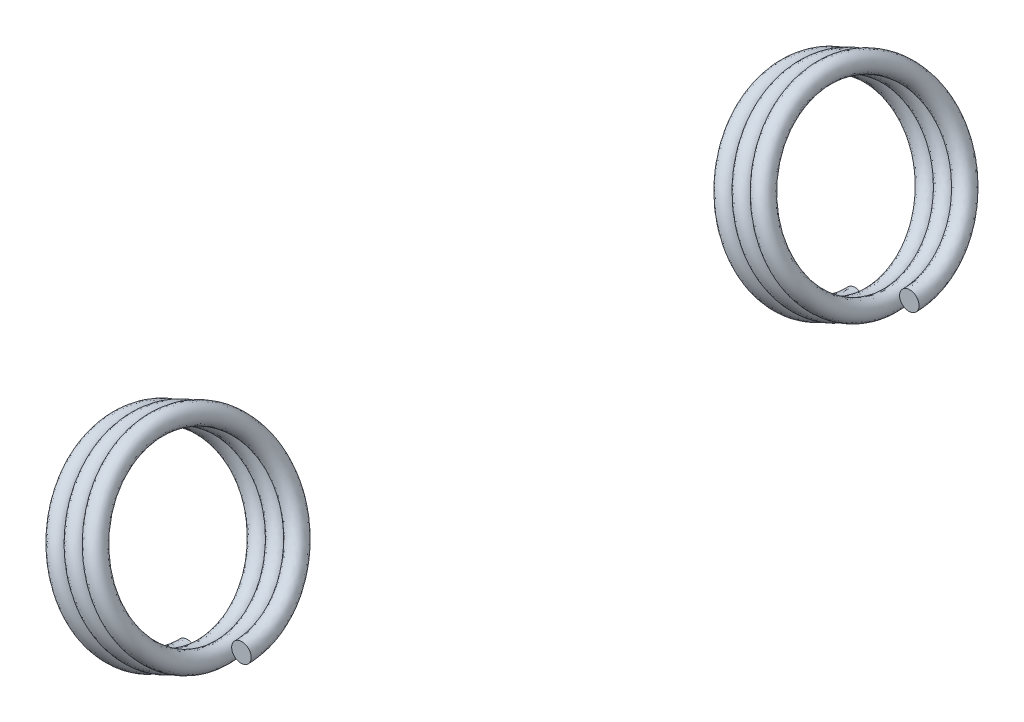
from build123d import *

# Parameters (mm, degrees)
MUELLE_IZQ_PITCH       = 1.7
MUELLE_IZQ_HEIGHT      = 5.1
MUELLE_IZQ_RADIUS      = 7.5
MUELLE_IZQ_START_ANGLE = 180
MUELLE_IZQ_PROFILE_R   = 0.8
MUELLE_DCHO_PITCH      = 1.7
MUELLE_DCHO_HEIGHT     = 5.1
MUELLE_DCHO_RADIUS     = 7.5
MUELLE_DCHO_PROFILE_R  = 0.8


with BuildPart() as part:
    # Muelle_izq: sweep along a helix
    with BuildLine() as muelle_izq_path:
        add(Helix(MUELLE_IZQ_PITCH, MUELLE_IZQ_HEIGHT, MUELLE_IZQ_RADIUS, center=(434.130302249, 385.128588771, -26), direction=(0.9070753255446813, 0.4209683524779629, 0), lefthand=True, mode=Mode.PRIVATE).rotate(Axis((434.130302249, 385.128588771, -26), (0.9070753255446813, 0.4209683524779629, 0)), MUELLE_IZQ_START_ANGLE))
    # Muelle_izq profile (on start of the path) → Muelle_izq (sweep)
    with BuildSketch(Plane(origin=(437.287564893, 378.32552383, -26), x_dir=(0.9994650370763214, 0, -0.03270534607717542), z_dir=(0.03270157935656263, 0.015176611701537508, 0.9993499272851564))):
        Circle(MUELLE_IZQ_PROFILE_R)
    sweep(path=muelle_izq_path.line, is_frenet=True)


with BuildPart() as body_2:
    # Muelle_dcho: sweep along a helix
    with BuildLine() as muelle_dcho_path:
        Helix(MUELLE_DCHO_PITCH, MUELLE_DCHO_HEIGHT, MUELLE_DCHO_RADIUS, center=(434.130302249, 385.128588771, 26), direction=(-0.9070753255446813, -0.4209683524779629, 0), lefthand=True)
    # Muelle_dcho profile (on start of the path) → Muelle_dcho (sweep)
    with BuildSketch(Plane(origin=(437.287564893, 378.32552383, 26), x_dir=(-0.9994650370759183, 0, 0.03270534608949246), z_dir=(-0.03270157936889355, -0.015176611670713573, -0.999349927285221))):
        Circle(MUELLE_DCHO_PROFILE_R)
    sweep(path=muelle_dcho_path.line, is_frenet=True)


solid = Compound([part.part, body_2.part])
